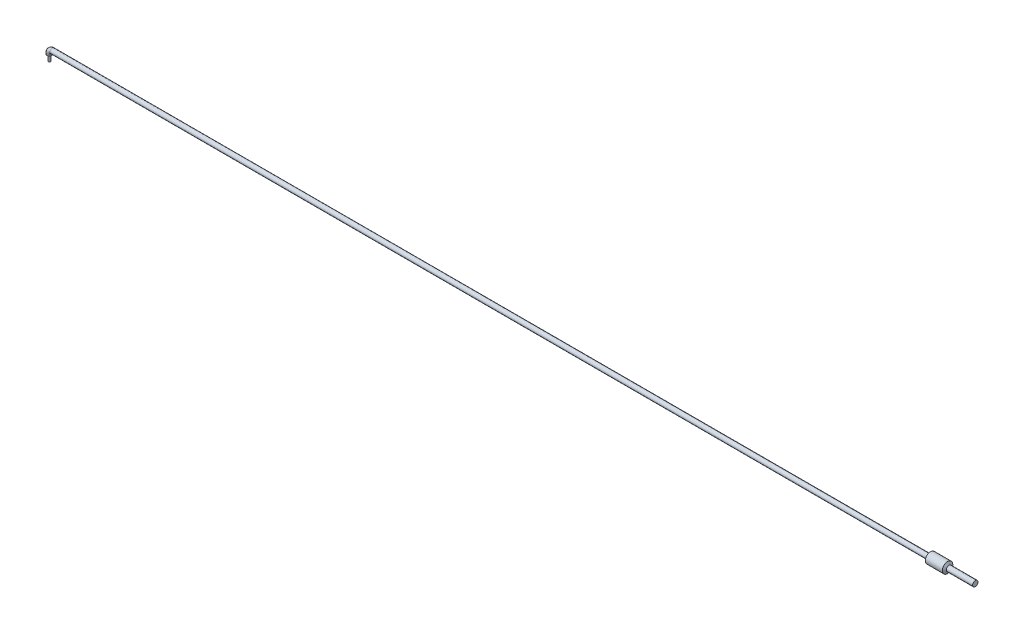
ISO-10303-21;
HEADER;
FILE_DESCRIPTION(('STEP AP214'),'2;1');
FILE_NAME('part.step','',(''),(''),'','','');
FILE_SCHEMA(('AUTOMOTIVE_DESIGN { 1 0 10303 214 1 1 1 1 }'));
ENDSEC;
DATA;
#1=APPLICATION_CONTEXT('core data for automotive mechanical design processes');
#2=APPLICATION_PROTOCOL_DEFINITION('international standard','automotive_design',2000,#1);
#3=PRODUCT_CONTEXT('',#1,'mechanical');
#4=PRODUCT('Part','Part','',(#3));
#5=PRODUCT_RELATED_PRODUCT_CATEGORY('part','',(#4));
#6=PRODUCT_DEFINITION_FORMATION('','',#4);
#7=PRODUCT_DEFINITION_CONTEXT('part definition',#1,'design');
#8=PRODUCT_DEFINITION('design','',#6,#7);
#9=PRODUCT_DEFINITION_SHAPE('','',#8);
#10=(LENGTH_UNIT() NAMED_UNIT(*) SI_UNIT(.MILLI.,.METRE.));
#11=(NAMED_UNIT(*) PLANE_ANGLE_UNIT() SI_UNIT($,.RADIAN.));
#12=(NAMED_UNIT(*) SI_UNIT($,.STERADIAN.) SOLID_ANGLE_UNIT());
#13=UNCERTAINTY_MEASURE_WITH_UNIT(LENGTH_MEASURE(1.E-05),#10,'distance_accuracy_value','');
#14=(GEOMETRIC_REPRESENTATION_CONTEXT(3) GLOBAL_UNCERTAINTY_ASSIGNED_CONTEXT((#13)) GLOBAL_UNIT_ASSIGNED_CONTEXT((#10,
#11,#12)) REPRESENTATION_CONTEXT('',''));
#15=CARTESIAN_POINT('',(0.,0.,0.));
#16=DIRECTION('',(0.,0.,1.));
#17=DIRECTION('',(1.,0.,0.));
#18=AXIS2_PLACEMENT_3D('',#15,#16,#17);
#19=CARTESIAN_POINT('',(0.,-2.,0.));
#20=DIRECTION('',(0.,-1.,0.));
#21=DIRECTION('',(0.,0.,-1.));
#22=AXIS2_PLACEMENT_3D('',#19,#20,#21);
#23=PLANE('',#22);
#24=CARTESIAN_POINT('',(0.,-2.,0.));
#25=DIRECTION('',(0.,1.,0.));
#26=DIRECTION('',(0.,0.,1.));
#27=AXIS2_PLACEMENT_3D('',#24,#25,#26);
#28=CIRCLE('',#27,0.35);
#29=CARTESIAN_POINT('',(0.,-2.,0.35));
#30=VERTEX_POINT('',#29);
#31=EDGE_CURVE('E17',#30,#30,#28,.T.);
#32=ORIENTED_EDGE('',*,*,#31,.F.);
#33=EDGE_LOOP('',(#32));
#34=FACE_BOUND('',#33,.T.);
#35=ADVANCED_FACE('F14',(#34),#23,.T.);
#36=CARTESIAN_POINT('',(310.,2.4,0.));
#37=DIRECTION('',(-1.,0.,0.));
#38=DIRECTION('',(0.,0.,1.));
#39=AXIS2_PLACEMENT_3D('',#36,#37,#38);
#40=PLANE('',#39);
#41=CARTESIAN_POINT('',(310.,1.5,0.));
#42=DIRECTION('',(-1.,0.,0.));
#43=DIRECTION('',(0.,0.,1.));
#44=AXIS2_PLACEMENT_3D('',#41,#42,#43);
#45=CIRCLE('',#44,0.9);
#46=CARTESIAN_POINT('',(310.,1.5,0.9));
#47=VERTEX_POINT('',#46);
#48=EDGE_CURVE('E42',#47,#47,#45,.T.);
#49=ORIENTED_EDGE('',*,*,#48,.F.);
#50=EDGE_LOOP('',(#49));
#51=FACE_BOUND('',#50,.T.);
#52=ADVANCED_FACE('F52',(#51),#40,.F.);
#53=CARTESIAN_POINT('',(0.,-2.,0.));
#54=DIRECTION('',(0.,1.,0.));
#55=DIRECTION('',(0.,0.,1.));
#56=AXIS2_PLACEMENT_3D('',#53,#54,#55);
#57=CYLINDRICAL_SURFACE('',#56,0.35);
#58=CARTESIAN_POINT('',(0.,0.,0.));
#59=DIRECTION('',(0.,1.,0.));
#60=DIRECTION('',(0.,0.,1.));
#61=AXIS2_PLACEMENT_3D('',#58,#59,#60);
#62=CIRCLE('',#61,0.35);
#63=CARTESIAN_POINT('',(0.,0.,0.35));
#64=VERTEX_POINT('',#63);
#65=EDGE_CURVE('E40',#64,#64,#62,.F.);
#66=ORIENTED_EDGE('',*,*,#65,.T.);
#67=EDGE_LOOP('',(#66));
#68=FACE_BOUND('',#67,.T.);
#69=ORIENTED_EDGE('',*,*,#31,.T.);
#70=EDGE_LOOP('',(#69));
#71=FACE_BOUND('',#70,.T.);
#72=ADVANCED_FACE('F49',(#68,#71),#57,.T.);
#73=CARTESIAN_POINT('',(300.,1.5,0.));
#74=DIRECTION('',(-1.,0.,0.));
#75=DIRECTION('',(0.,0.,1.));
#76=AXIS2_PLACEMENT_3D('',#73,#74,#75);
#77=CYLINDRICAL_SURFACE('',#76,0.9);
#78=ORIENTED_EDGE('',*,*,#48,.T.);
#79=EDGE_LOOP('',(#78));
#80=FACE_BOUND('',#79,.T.);
#81=CARTESIAN_POINT('',(301.199999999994,1.5,0.));
#82=DIRECTION('',(-1.,0.,0.));
#83=DIRECTION('',(0.,0.,1.));
#84=AXIS2_PLACEMENT_3D('',#81,#82,#83);
#85=CIRCLE('',#84,0.899999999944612);
#86=CARTESIAN_POINT('',(301.199999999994,1.5,0.899999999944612));
#87=VERTEX_POINT('',#86);
#88=EDGE_CURVE('E39',#87,#87,#85,.T.);
#89=ORIENTED_EDGE('',*,*,#88,.F.);
#90=EDGE_LOOP('',(#89));
#91=FACE_BOUND('',#90,.T.);
#92=ADVANCED_FACE('F93',(#80,#91),#77,.T.);
#93=CARTESIAN_POINT('',(0.,0.,0.));
#94=DIRECTION('',(0.,1.,0.));
#95=DIRECTION('',(0.,0.,1.));
#96=AXIS2_PLACEMENT_3D('',#93,#94,#95);
#97=PLANE('',#96);
#98=ORIENTED_EDGE('',*,*,#65,.F.);
#99=EDGE_LOOP('',(#98));
#100=FACE_BOUND('',#99,.T.);
#101=CARTESIAN_POINT('',(0.,0.,0.));
#102=DIRECTION('',(0.,-1.,0.));
#103=DIRECTION('',(0.,0.,-1.));
#104=AXIS2_PLACEMENT_3D('',#101,#102,#103);
#105=CIRCLE('',#104,0.8);
#106=CARTESIAN_POINT('',(0.,0.,-0.8));
#107=VERTEX_POINT('',#106);
#108=EDGE_CURVE('E35',#107,#107,#105,.F.);
#109=ORIENTED_EDGE('',*,*,#108,.F.);
#110=EDGE_LOOP('',(#109));
#111=FACE_BOUND('',#110,.T.);
#112=ADVANCED_FACE('F95',(#100,#111),#97,.F.);
#113=CARTESIAN_POINT('',(300.709252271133,1.5,0.));
#114=DIRECTION('',(-1.,0.,0.));
#115=DIRECTION('',(0.,0.,1.));
#116=AXIS2_PLACEMENT_3D('',#113,#114,#115);
#117=CONICAL_SURFACE('',#116,1.75000000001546,1.0471975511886);
#118=ORIENTED_EDGE('',*,*,#88,.T.);
#119=EDGE_LOOP('',(#118));
#120=FACE_BOUND('',#119,.T.);
#121=CARTESIAN_POINT('',(300.709252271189,1.5,0.));
#122=DIRECTION('',(-1.,0.,0.));
#123=DIRECTION('',(0.,0.,1.));
#124=AXIS2_PLACEMENT_3D('',#121,#122,#123);
#125=CIRCLE('',#124,1.75);
#126=CARTESIAN_POINT('',(300.709252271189,1.5,1.75));
#127=VERTEX_POINT('',#126);
#128=EDGE_CURVE('E38',#127,#127,#125,.T.);
#129=ORIENTED_EDGE('',*,*,#128,.F.);
#130=EDGE_LOOP('',(#129));
#131=FACE_BOUND('',#130,.T.);
#132=ADVANCED_FACE('F90',(#120,#131),#117,.T.);
#133=CARTESIAN_POINT('',(0.,0.5,0.));
#134=DIRECTION('',(0.,-1.,0.));
#135=DIRECTION('',(0.,0.,-1.));
#136=AXIS2_PLACEMENT_3D('',#133,#134,#135);
#137=CYLINDRICAL_SURFACE('',#136,0.8);
#138=ORIENTED_EDGE('',*,*,#108,.T.);
#139=EDGE_LOOP('',(#138));
#140=FACE_BOUND('',#139,.T.);
#141=CARTESIAN_POINT('',(0.,0.5,0.));
#142=DIRECTION('',(0.,1.,0.));
#143=DIRECTION('',(-1.,0.,0.));
#144=AXIS2_PLACEMENT_3D('',#141,#142,#143);
#145=CIRCLE('',#144,0.8);
#146=CARTESIAN_POINT('',(-0.8,0.5,0.));
#147=VERTEX_POINT('',#146);
#148=EDGE_CURVE('E34',#147,#147,#145,.T.);
#149=ORIENTED_EDGE('',*,*,#148,.F.);
#150=EDGE_LOOP('',(#149));
#151=FACE_BOUND('',#150,.T.);
#152=ADVANCED_FACE('F107',(#140,#151),#137,.T.);
#153=CARTESIAN_POINT('',(300.,1.5,0.));
#154=DIRECTION('',(-1.,0.,0.));
#155=DIRECTION('',(0.,0.,1.));
#156=AXIS2_PLACEMENT_3D('',#153,#154,#155);
#157=CYLINDRICAL_SURFACE('',#156,1.75);
#158=ORIENTED_EDGE('',*,*,#128,.T.);
#159=EDGE_LOOP('',(#158));
#160=FACE_BOUND('',#159,.T.);
#161=CARTESIAN_POINT('',(295.,1.5,0.));
#162=DIRECTION('',(-1.,0.,0.));
#163=DIRECTION('',(0.,0.,1.));
#164=AXIS2_PLACEMENT_3D('',#161,#162,#163);
#165=CIRCLE('',#164,1.75);
#166=CARTESIAN_POINT('',(295.,1.5,1.75));
#167=VERTEX_POINT('',#166);
#168=EDGE_CURVE('E26',#167,#167,#165,.F.);
#169=ORIENTED_EDGE('',*,*,#168,.T.);
#170=EDGE_LOOP('',(#169));
#171=FACE_BOUND('',#170,.T.);
#172=ADVANCED_FACE('F73',(#160,#171),#157,.T.);
#173=CARTESIAN_POINT('',(1.,0.5,0.));
#174=DIRECTION('',(0.,0.,-1.));
#175=DIRECTION('',(-1.,0.,0.));
#176=AXIS2_PLACEMENT_3D('',#173,#174,#175);
#177=TOROIDAL_SURFACE('',#176,1.,0.8);
#178=CARTESIAN_POINT('',(1.,1.5,0.));
#179=DIRECTION('',(1.,0.,0.));
#180=DIRECTION('',(0.,1.,0.));
#181=AXIS2_PLACEMENT_3D('',#178,#179,#180);
#182=CIRCLE('',#181,0.8);
#183=CARTESIAN_POINT('',(1.,2.3,0.));
#184=VERTEX_POINT('',#183);
#185=EDGE_CURVE('E21',#184,#184,#182,.T.);
#186=ORIENTED_EDGE('',*,*,#185,.F.);
#187=EDGE_LOOP('',(#186));
#188=FACE_BOUND('',#187,.T.);
#189=ORIENTED_EDGE('',*,*,#148,.T.);
#190=EDGE_LOOP('',(#189));
#191=FACE_BOUND('',#190,.T.);
#192=ADVANCED_FACE('F65',(#188,#191),#177,.T.);
#193=CARTESIAN_POINT('',(295.,1.50000000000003,0.));
#194=DIRECTION('',(1.,0.,0.));
#195=DIRECTION('',(0.,0.,-1.));
#196=AXIS2_PLACEMENT_3D('',#193,#194,#195);
#197=PLANE('',#196);
#198=ORIENTED_EDGE('',*,*,#168,.F.);
#199=EDGE_LOOP('',(#198));
#200=FACE_BOUND('',#199,.T.);
#201=CARTESIAN_POINT('',(295.,1.5,0.));
#202=DIRECTION('',(1.,0.,0.));
#203=DIRECTION('',(0.,1.,0.));
#204=AXIS2_PLACEMENT_3D('',#201,#202,#203);
#205=CIRCLE('',#204,0.8);
#206=CARTESIAN_POINT('',(295.,2.3,0.));
#207=VERTEX_POINT('',#206);
#208=EDGE_CURVE('E10',#207,#207,#205,.F.);
#209=ORIENTED_EDGE('',*,*,#208,.F.);
#210=EDGE_LOOP('',(#209));
#211=FACE_BOUND('',#210,.T.);
#212=ADVANCED_FACE('F60',(#200,#211),#197,.F.);
#213=CARTESIAN_POINT('',(1.,1.5,0.));
#214=DIRECTION('',(1.,0.,0.));
#215=DIRECTION('',(0.,1.,0.));
#216=AXIS2_PLACEMENT_3D('',#213,#214,#215);
#217=CYLINDRICAL_SURFACE('',#216,0.8);
#218=ORIENTED_EDGE('',*,*,#208,.T.);
#219=EDGE_LOOP('',(#218));
#220=FACE_BOUND('',#219,.T.);
#221=ORIENTED_EDGE('',*,*,#185,.T.);
#222=EDGE_LOOP('',(#221));
#223=FACE_BOUND('',#222,.T.);
#224=ADVANCED_FACE('F58',(#220,#223),#217,.T.);
#225=CLOSED_SHELL('',(#35,#52,#72,#92,#112,#132,#152,#172,#192,#212,#224));
#226=MANIFOLD_SOLID_BREP('B1',#225);
#227=ADVANCED_BREP_SHAPE_REPRESENTATION('',(#18,#226),#14);
#228=SHAPE_DEFINITION_REPRESENTATION(#9,#227);
ENDSEC;
END-ISO-10303-21;
